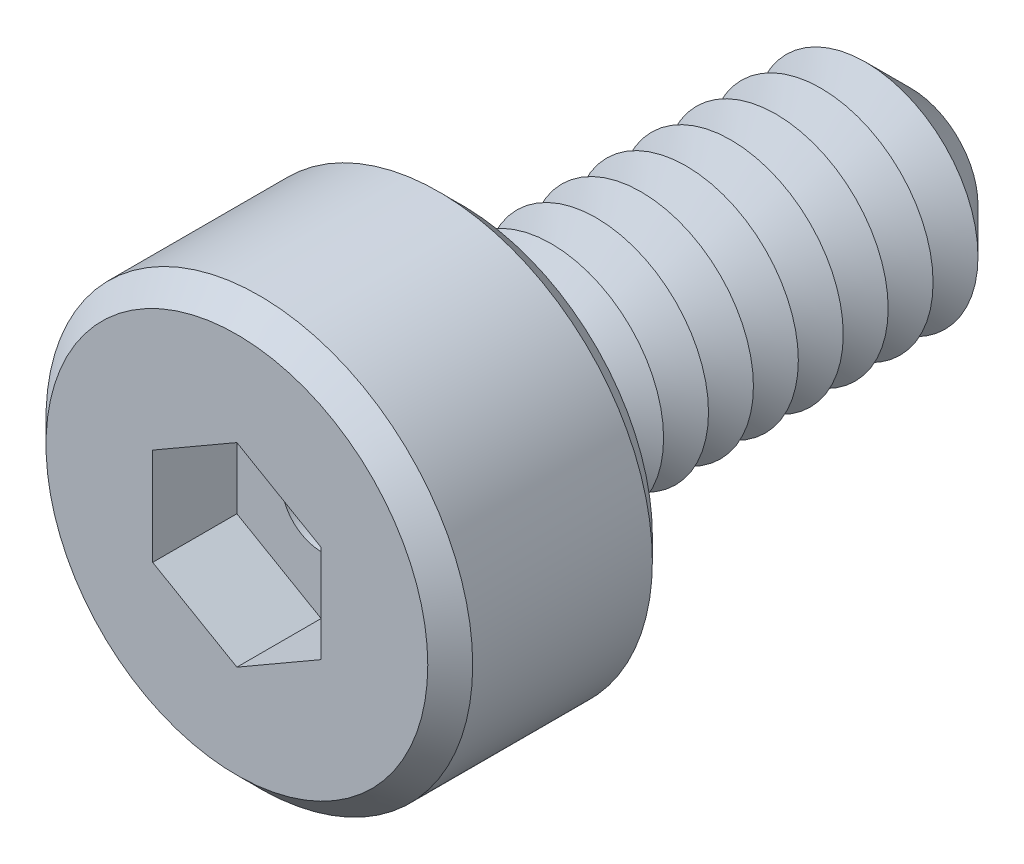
ISO-10303-21;
HEADER;
FILE_DESCRIPTION(('STEP AP214'),'2;1');
FILE_NAME('part.step','',(''),(''),'','','');
FILE_SCHEMA(('AUTOMOTIVE_DESIGN { 1 0 10303 214 1 1 1 1 }'));
ENDSEC;
DATA;
#1=APPLICATION_CONTEXT('core data for automotive mechanical design processes');
#2=APPLICATION_PROTOCOL_DEFINITION('international standard','automotive_design',2000,#1);
#3=PRODUCT_CONTEXT('',#1,'mechanical');
#4=PRODUCT('Part','Part','',(#3));
#5=PRODUCT_RELATED_PRODUCT_CATEGORY('part','',(#4));
#6=PRODUCT_DEFINITION_FORMATION('','',#4);
#7=PRODUCT_DEFINITION_CONTEXT('part definition',#1,'design');
#8=PRODUCT_DEFINITION('design','',#6,#7);
#9=PRODUCT_DEFINITION_SHAPE('','',#8);
#10=(LENGTH_UNIT() NAMED_UNIT(*) SI_UNIT(.MILLI.,.METRE.));
#11=(NAMED_UNIT(*) PLANE_ANGLE_UNIT() SI_UNIT($,.RADIAN.));
#12=(NAMED_UNIT(*) SI_UNIT($,.STERADIAN.) SOLID_ANGLE_UNIT());
#13=UNCERTAINTY_MEASURE_WITH_UNIT(LENGTH_MEASURE(1.E-05),#10,'distance_accuracy_value','');
#14=(GEOMETRIC_REPRESENTATION_CONTEXT(3) GLOBAL_UNCERTAINTY_ASSIGNED_CONTEXT((#13)) GLOBAL_UNIT_ASSIGNED_CONTEXT((#10,
#11,#12)) REPRESENTATION_CONTEXT('',''));
#15=CARTESIAN_POINT('',(0.,0.,0.));
#16=DIRECTION('',(0.,0.,1.));
#17=DIRECTION('',(1.,0.,0.));
#18=AXIS2_PLACEMENT_3D('',#15,#16,#17);
#19=CARTESIAN_POINT('',(0.,0.,2.));
#20=DIRECTION('',(0.,0.,-1.));
#21=DIRECTION('',(-1.,0.,0.));
#22=AXIS2_PLACEMENT_3D('',#19,#20,#21);
#23=CYLINDRICAL_SURFACE('',#22,1.9);
#24=CARTESIAN_POINT('',(0.,0.,0.2));
#25=DIRECTION('',(0.,0.,1.));
#26=DIRECTION('',(1.,0.,0.));
#27=AXIS2_PLACEMENT_3D('',#24,#25,#26);
#28=CIRCLE('',#27,1.9);
#29=CARTESIAN_POINT('',(1.9,0.,0.2));
#30=VERTEX_POINT('',#29);
#31=EDGE_CURVE('E248',#30,#30,#28,.T.);
#32=ORIENTED_EDGE('',*,*,#31,.T.);
#33=EDGE_LOOP('',(#32));
#34=FACE_BOUND('',#33,.T.);
#35=CARTESIAN_POINT('',(0.,0.,1.8));
#36=DIRECTION('',(0.,0.,1.));
#37=DIRECTION('',(1.,0.,0.));
#38=AXIS2_PLACEMENT_3D('',#35,#36,#37);
#39=CIRCLE('',#38,1.9);
#40=CARTESIAN_POINT('',(1.9,0.,1.8));
#41=VERTEX_POINT('',#40);
#42=EDGE_CURVE('E244',#41,#41,#39,.F.);
#43=ORIENTED_EDGE('',*,*,#42,.T.);
#44=EDGE_LOOP('',(#43));
#45=FACE_BOUND('',#44,.T.);
#46=ADVANCED_FACE('F39',(#34,#45),#23,.T.);
#47=CARTESIAN_POINT('',(0.,0.,2.));
#48=DIRECTION('',(0.,0.,1.));
#49=DIRECTION('',(1.,0.,0.));
#50=AXIS2_PLACEMENT_3D('',#47,#48,#49);
#51=PLANE('',#50);
#52=CARTESIAN_POINT('',(0.,0.,2.));
#53=DIRECTION('',(0.,0.,1.));
#54=DIRECTION('',(1.,0.,0.));
#55=AXIS2_PLACEMENT_3D('',#52,#53,#54);
#56=CIRCLE('',#55,1.7);
#57=CARTESIAN_POINT('',(1.7,0.,2.));
#58=VERTEX_POINT('',#57);
#59=EDGE_CURVE('E11',#58,#58,#56,.T.);
#60=ORIENTED_EDGE('',*,*,#59,.T.);
#61=EDGE_LOOP('',(#60));
#62=FACE_BOUND('',#61,.T.);
#63=DIRECTION('',(-0.866025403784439,0.5,0.));
#64=VECTOR('',#63,1.);
#65=CARTESIAN_POINT('',(0.75,0.43301270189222,2.));
#66=LINE('',#65,#64);
#67=CARTESIAN_POINT('',(0.75,0.43301270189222,2.));
#68=VERTEX_POINT('',#67);
#69=CARTESIAN_POINT('',(0.,0.866025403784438,2.));
#70=VERTEX_POINT('',#69);
#71=EDGE_CURVE('E55',#68,#70,#66,.T.);
#72=ORIENTED_EDGE('',*,*,#71,.F.);
#73=DIRECTION('',(0.,1.,0.));
#74=VECTOR('',#73,1.);
#75=CARTESIAN_POINT('',(0.75,-0.433012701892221,2.));
#76=LINE('',#75,#74);
#77=CARTESIAN_POINT('',(0.75,-0.433012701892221,2.));
#78=VERTEX_POINT('',#77);
#79=EDGE_CURVE('E150',#78,#68,#76,.T.);
#80=ORIENTED_EDGE('',*,*,#79,.F.);
#81=DIRECTION('',(0.866025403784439,0.499999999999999,0.));
#82=VECTOR('',#81,1.);
#83=CARTESIAN_POINT('',(0.,-0.866025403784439,2.));
#84=LINE('',#83,#82);
#85=CARTESIAN_POINT('',(0.,-0.866025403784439,2.));
#86=VERTEX_POINT('',#85);
#87=EDGE_CURVE('E147',#86,#78,#84,.T.);
#88=ORIENTED_EDGE('',*,*,#87,.F.);
#89=DIRECTION('',(0.866025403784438,-0.5,0.));
#90=VECTOR('',#89,1.);
#91=CARTESIAN_POINT('',(-0.750000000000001,-0.43301270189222,2.));
#92=LINE('',#91,#90);
#93=CARTESIAN_POINT('',(-0.750000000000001,-0.43301270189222,2.));
#94=VERTEX_POINT('',#93);
#95=EDGE_CURVE('E103',#94,#86,#92,.T.);
#96=ORIENTED_EDGE('',*,*,#95,.F.);
#97=DIRECTION('',(0.,-1.,0.));
#98=VECTOR('',#97,1.);
#99=CARTESIAN_POINT('',(-0.750000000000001,0.433012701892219,2.));
#100=LINE('',#99,#98);
#101=CARTESIAN_POINT('',(-0.750000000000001,0.433012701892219,2.));
#102=VERTEX_POINT('',#101);
#103=EDGE_CURVE('E141',#102,#94,#100,.T.);
#104=ORIENTED_EDGE('',*,*,#103,.F.);
#105=DIRECTION('',(-0.866025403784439,-0.499999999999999,0.));
#106=VECTOR('',#105,1.);
#107=CARTESIAN_POINT('',(0.,0.866025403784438,2.));
#108=LINE('',#107,#106);
#109=EDGE_CURVE('E137',#70,#102,#108,.T.);
#110=ORIENTED_EDGE('',*,*,#109,.F.);
#111=EDGE_LOOP('',(#72,#80,#88,#96,#104,#110));
#112=FACE_BOUND('',#111,.T.);
#113=ADVANCED_FACE('F266',(#62,#112),#51,.T.);
#114=CARTESIAN_POINT('',(0.,0.,0.));
#115=DIRECTION('',(0.,0.,1.));
#116=DIRECTION('',(1.,0.,0.));
#117=AXIS2_PLACEMENT_3D('',#114,#115,#116);
#118=PLANE('',#117);
#119=CARTESIAN_POINT('',(0.,0.,0.));
#120=DIRECTION('',(0.,0.,1.));
#121=DIRECTION('',(1.,0.,0.));
#122=AXIS2_PLACEMENT_3D('',#119,#120,#121);
#123=CIRCLE('',#122,1.7);
#124=CARTESIAN_POINT('',(1.7,0.,0.));
#125=VERTEX_POINT('',#124);
#126=EDGE_CURVE('E48',#125,#125,#123,.F.);
#127=ORIENTED_EDGE('',*,*,#126,.T.);
#128=EDGE_LOOP('',(#127));
#129=FACE_BOUND('',#128,.T.);
#130=CARTESIAN_POINT('',(0.,0.,0.));
#131=DIRECTION('',(0.,0.,1.));
#132=DIRECTION('',(1.,0.,0.));
#133=AXIS2_PLACEMENT_3D('',#130,#131,#132);
#134=CIRCLE('',#133,1.);
#135=CARTESIAN_POINT('',(1.,0.,0.));
#136=VERTEX_POINT('',#135);
#137=EDGE_CURVE('E236',#136,#136,#134,.T.);
#138=ORIENTED_EDGE('',*,*,#137,.T.);
#139=EDGE_LOOP('',(#138));
#140=FACE_BOUND('',#139,.T.);
#141=ADVANCED_FACE('F255',(#129,#140),#118,.F.);
#142=CARTESIAN_POINT('',(0.,0.,0.));
#143=DIRECTION('',(0.,0.,1.));
#144=DIRECTION('',(1.,0.,0.));
#145=AXIS2_PLACEMENT_3D('',#142,#143,#144);
#146=CONICAL_SURFACE('',#145,1.,1.0471975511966);
#147=CARTESIAN_POINT('',(0.,0.,-0.2));
#148=DIRECTION('',(0.,0.,1.));
#149=DIRECTION('',(1.,0.,0.));
#150=AXIS2_PLACEMENT_3D('',#147,#148,#149);
#151=CIRCLE('',#150,0.653589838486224);
#152=CARTESIAN_POINT('',(0.653589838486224,0.,-0.2));
#153=VERTEX_POINT('',#152);
#154=EDGE_CURVE('E232',#153,#153,#151,.T.);
#155=ORIENTED_EDGE('',*,*,#154,.T.);
#156=EDGE_LOOP('',(#155));
#157=FACE_BOUND('',#156,.T.);
#158=ORIENTED_EDGE('',*,*,#137,.F.);
#159=EDGE_LOOP('',(#158));
#160=FACE_BOUND('',#159,.T.);
#161=ADVANCED_FACE('F388',(#157,#160),#146,.T.);
#162=CARTESIAN_POINT('',(0.,0.,-0.2));
#163=DIRECTION('',(0.,0.,-1.));
#164=DIRECTION('',(-1.,0.,0.));
#165=AXIS2_PLACEMENT_3D('',#162,#163,#164);
#166=CONICAL_SURFACE('',#165,0.653589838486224,1.0471975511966);
#167=CARTESIAN_POINT('',(0.,0.,-0.4));
#168=DIRECTION('',(0.,0.,1.));
#169=DIRECTION('',(1.,0.,0.));
#170=AXIS2_PLACEMENT_3D('',#167,#168,#169);
#171=CIRCLE('',#170,1.);
#172=CARTESIAN_POINT('',(1.,0.,-0.4));
#173=VERTEX_POINT('',#172);
#174=EDGE_CURVE('E228',#173,#173,#171,.T.);
#175=ORIENTED_EDGE('',*,*,#174,.T.);
#176=EDGE_LOOP('',(#175));
#177=FACE_BOUND('',#176,.T.);
#178=ORIENTED_EDGE('',*,*,#154,.F.);
#179=EDGE_LOOP('',(#178));
#180=FACE_BOUND('',#179,.T.);
#181=ADVANCED_FACE('F384',(#177,#180),#166,.T.);
#182=CARTESIAN_POINT('',(0.,0.,-0.4));
#183=DIRECTION('',(0.,0.,1.));
#184=DIRECTION('',(1.,0.,0.));
#185=AXIS2_PLACEMENT_3D('',#182,#183,#184);
#186=CONICAL_SURFACE('',#185,1.,1.0471975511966);
#187=CARTESIAN_POINT('',(0.,0.,-0.6));
#188=DIRECTION('',(0.,0.,1.));
#189=DIRECTION('',(1.,0.,0.));
#190=AXIS2_PLACEMENT_3D('',#187,#188,#189);
#191=CIRCLE('',#190,0.653589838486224);
#192=CARTESIAN_POINT('',(0.653589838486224,0.,-0.6));
#193=VERTEX_POINT('',#192);
#194=EDGE_CURVE('E224',#193,#193,#191,.T.);
#195=ORIENTED_EDGE('',*,*,#194,.T.);
#196=EDGE_LOOP('',(#195));
#197=FACE_BOUND('',#196,.T.);
#198=ORIENTED_EDGE('',*,*,#174,.F.);
#199=EDGE_LOOP('',(#198));
#200=FACE_BOUND('',#199,.T.);
#201=ADVANCED_FACE('F380',(#197,#200),#186,.T.);
#202=CARTESIAN_POINT('',(0.,0.,-0.6));
#203=DIRECTION('',(0.,0.,-1.));
#204=DIRECTION('',(-1.,0.,0.));
#205=AXIS2_PLACEMENT_3D('',#202,#203,#204);
#206=CONICAL_SURFACE('',#205,0.653589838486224,1.0471975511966);
#207=CARTESIAN_POINT('',(0.,0.,-0.8));
#208=DIRECTION('',(0.,0.,1.));
#209=DIRECTION('',(1.,0.,0.));
#210=AXIS2_PLACEMENT_3D('',#207,#208,#209);
#211=CIRCLE('',#210,1.);
#212=CARTESIAN_POINT('',(1.,0.,-0.8));
#213=VERTEX_POINT('',#212);
#214=EDGE_CURVE('E220',#213,#213,#211,.T.);
#215=ORIENTED_EDGE('',*,*,#214,.T.);
#216=EDGE_LOOP('',(#215));
#217=FACE_BOUND('',#216,.T.);
#218=ORIENTED_EDGE('',*,*,#194,.F.);
#219=EDGE_LOOP('',(#218));
#220=FACE_BOUND('',#219,.T.);
#221=ADVANCED_FACE('F376',(#217,#220),#206,.T.);
#222=CARTESIAN_POINT('',(0.,0.,-0.8));
#223=DIRECTION('',(0.,0.,1.));
#224=DIRECTION('',(1.,0.,0.));
#225=AXIS2_PLACEMENT_3D('',#222,#223,#224);
#226=CONICAL_SURFACE('',#225,1.,1.0471975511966);
#227=CARTESIAN_POINT('',(0.,0.,-1.));
#228=DIRECTION('',(0.,0.,1.));
#229=DIRECTION('',(1.,0.,0.));
#230=AXIS2_PLACEMENT_3D('',#227,#228,#229);
#231=CIRCLE('',#230,0.653589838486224);
#232=CARTESIAN_POINT('',(0.653589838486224,0.,-1.));
#233=VERTEX_POINT('',#232);
#234=EDGE_CURVE('E216',#233,#233,#231,.T.);
#235=ORIENTED_EDGE('',*,*,#234,.T.);
#236=EDGE_LOOP('',(#235));
#237=FACE_BOUND('',#236,.T.);
#238=ORIENTED_EDGE('',*,*,#214,.F.);
#239=EDGE_LOOP('',(#238));
#240=FACE_BOUND('',#239,.T.);
#241=ADVANCED_FACE('F372',(#237,#240),#226,.T.);
#242=CARTESIAN_POINT('',(0.,0.,-1.));
#243=DIRECTION('',(0.,0.,-1.));
#244=DIRECTION('',(-1.,0.,0.));
#245=AXIS2_PLACEMENT_3D('',#242,#243,#244);
#246=CONICAL_SURFACE('',#245,0.653589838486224,1.0471975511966);
#247=CARTESIAN_POINT('',(0.,0.,-1.2));
#248=DIRECTION('',(0.,0.,1.));
#249=DIRECTION('',(1.,0.,0.));
#250=AXIS2_PLACEMENT_3D('',#247,#248,#249);
#251=CIRCLE('',#250,1.);
#252=CARTESIAN_POINT('',(1.,0.,-1.2));
#253=VERTEX_POINT('',#252);
#254=EDGE_CURVE('E212',#253,#253,#251,.T.);
#255=ORIENTED_EDGE('',*,*,#254,.T.);
#256=EDGE_LOOP('',(#255));
#257=FACE_BOUND('',#256,.T.);
#258=ORIENTED_EDGE('',*,*,#234,.F.);
#259=EDGE_LOOP('',(#258));
#260=FACE_BOUND('',#259,.T.);
#261=ADVANCED_FACE('F368',(#257,#260),#246,.T.);
#262=CARTESIAN_POINT('',(0.,0.,-1.2));
#263=DIRECTION('',(0.,0.,1.));
#264=DIRECTION('',(1.,0.,0.));
#265=AXIS2_PLACEMENT_3D('',#262,#263,#264);
#266=CONICAL_SURFACE('',#265,1.,1.0471975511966);
#267=CARTESIAN_POINT('',(0.,0.,-1.4));
#268=DIRECTION('',(0.,0.,1.));
#269=DIRECTION('',(1.,0.,0.));
#270=AXIS2_PLACEMENT_3D('',#267,#268,#269);
#271=CIRCLE('',#270,0.653589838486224);
#272=CARTESIAN_POINT('',(0.653589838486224,0.,-1.4));
#273=VERTEX_POINT('',#272);
#274=EDGE_CURVE('E208',#273,#273,#271,.T.);
#275=ORIENTED_EDGE('',*,*,#274,.T.);
#276=EDGE_LOOP('',(#275));
#277=FACE_BOUND('',#276,.T.);
#278=ORIENTED_EDGE('',*,*,#254,.F.);
#279=EDGE_LOOP('',(#278));
#280=FACE_BOUND('',#279,.T.);
#281=ADVANCED_FACE('F364',(#277,#280),#266,.T.);
#282=CARTESIAN_POINT('',(0.,0.,-1.4));
#283=DIRECTION('',(0.,0.,-1.));
#284=DIRECTION('',(-1.,0.,0.));
#285=AXIS2_PLACEMENT_3D('',#282,#283,#284);
#286=CONICAL_SURFACE('',#285,0.653589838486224,1.0471975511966);
#287=CARTESIAN_POINT('',(0.,0.,-1.6));
#288=DIRECTION('',(0.,0.,1.));
#289=DIRECTION('',(1.,0.,0.));
#290=AXIS2_PLACEMENT_3D('',#287,#288,#289);
#291=CIRCLE('',#290,1.);
#292=CARTESIAN_POINT('',(1.,0.,-1.6));
#293=VERTEX_POINT('',#292);
#294=EDGE_CURVE('E204',#293,#293,#291,.T.);
#295=ORIENTED_EDGE('',*,*,#294,.T.);
#296=EDGE_LOOP('',(#295));
#297=FACE_BOUND('',#296,.T.);
#298=ORIENTED_EDGE('',*,*,#274,.F.);
#299=EDGE_LOOP('',(#298));
#300=FACE_BOUND('',#299,.T.);
#301=ADVANCED_FACE('F360',(#297,#300),#286,.T.);
#302=CARTESIAN_POINT('',(0.,0.,-1.6));
#303=DIRECTION('',(0.,0.,1.));
#304=DIRECTION('',(1.,0.,0.));
#305=AXIS2_PLACEMENT_3D('',#302,#303,#304);
#306=CONICAL_SURFACE('',#305,1.,1.0471975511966);
#307=CARTESIAN_POINT('',(0.,0.,-1.8));
#308=DIRECTION('',(0.,0.,1.));
#309=DIRECTION('',(1.,0.,0.));
#310=AXIS2_PLACEMENT_3D('',#307,#308,#309);
#311=CIRCLE('',#310,0.653589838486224);
#312=CARTESIAN_POINT('',(0.653589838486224,0.,-1.8));
#313=VERTEX_POINT('',#312);
#314=EDGE_CURVE('E200',#313,#313,#311,.T.);
#315=ORIENTED_EDGE('',*,*,#314,.T.);
#316=EDGE_LOOP('',(#315));
#317=FACE_BOUND('',#316,.T.);
#318=ORIENTED_EDGE('',*,*,#294,.F.);
#319=EDGE_LOOP('',(#318));
#320=FACE_BOUND('',#319,.T.);
#321=ADVANCED_FACE('F356',(#317,#320),#306,.T.);
#322=CARTESIAN_POINT('',(0.,0.,-1.8));
#323=DIRECTION('',(0.,0.,-1.));
#324=DIRECTION('',(-1.,0.,0.));
#325=AXIS2_PLACEMENT_3D('',#322,#323,#324);
#326=CONICAL_SURFACE('',#325,0.653589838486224,1.0471975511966);
#327=CARTESIAN_POINT('',(0.,0.,-2.));
#328=DIRECTION('',(0.,0.,1.));
#329=DIRECTION('',(1.,0.,0.));
#330=AXIS2_PLACEMENT_3D('',#327,#328,#329);
#331=CIRCLE('',#330,1.);
#332=CARTESIAN_POINT('',(1.,0.,-2.));
#333=VERTEX_POINT('',#332);
#334=EDGE_CURVE('E196',#333,#333,#331,.T.);
#335=ORIENTED_EDGE('',*,*,#334,.T.);
#336=EDGE_LOOP('',(#335));
#337=FACE_BOUND('',#336,.T.);
#338=ORIENTED_EDGE('',*,*,#314,.F.);
#339=EDGE_LOOP('',(#338));
#340=FACE_BOUND('',#339,.T.);
#341=ADVANCED_FACE('F352',(#337,#340),#326,.T.);
#342=CARTESIAN_POINT('',(0.,0.,-2.));
#343=DIRECTION('',(0.,0.,1.));
#344=DIRECTION('',(1.,0.,0.));
#345=AXIS2_PLACEMENT_3D('',#342,#343,#344);
#346=CONICAL_SURFACE('',#345,1.,1.0471975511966);
#347=CARTESIAN_POINT('',(0.,0.,-2.2));
#348=DIRECTION('',(0.,0.,1.));
#349=DIRECTION('',(1.,0.,0.));
#350=AXIS2_PLACEMENT_3D('',#347,#348,#349);
#351=CIRCLE('',#350,0.653589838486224);
#352=CARTESIAN_POINT('',(0.653589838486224,0.,-2.2));
#353=VERTEX_POINT('',#352);
#354=EDGE_CURVE('E192',#353,#353,#351,.T.);
#355=ORIENTED_EDGE('',*,*,#354,.T.);
#356=EDGE_LOOP('',(#355));
#357=FACE_BOUND('',#356,.T.);
#358=ORIENTED_EDGE('',*,*,#334,.F.);
#359=EDGE_LOOP('',(#358));
#360=FACE_BOUND('',#359,.T.);
#361=ADVANCED_FACE('F348',(#357,#360),#346,.T.);
#362=CARTESIAN_POINT('',(0.,0.,-2.2));
#363=DIRECTION('',(0.,0.,-1.));
#364=DIRECTION('',(-1.,0.,0.));
#365=AXIS2_PLACEMENT_3D('',#362,#363,#364);
#366=CONICAL_SURFACE('',#365,0.653589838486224,1.0471975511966);
#367=CARTESIAN_POINT('',(0.,0.,-2.4));
#368=DIRECTION('',(0.,0.,1.));
#369=DIRECTION('',(1.,0.,0.));
#370=AXIS2_PLACEMENT_3D('',#367,#368,#369);
#371=CIRCLE('',#370,1.);
#372=CARTESIAN_POINT('',(1.,0.,-2.4));
#373=VERTEX_POINT('',#372);
#374=EDGE_CURVE('E188',#373,#373,#371,.T.);
#375=ORIENTED_EDGE('',*,*,#374,.T.);
#376=EDGE_LOOP('',(#375));
#377=FACE_BOUND('',#376,.T.);
#378=ORIENTED_EDGE('',*,*,#354,.F.);
#379=EDGE_LOOP('',(#378));
#380=FACE_BOUND('',#379,.T.);
#381=ADVANCED_FACE('F344',(#377,#380),#366,.T.);
#382=CARTESIAN_POINT('',(0.,0.,-2.4));
#383=DIRECTION('',(0.,0.,1.));
#384=DIRECTION('',(1.,0.,0.));
#385=AXIS2_PLACEMENT_3D('',#382,#383,#384);
#386=CONICAL_SURFACE('',#385,1.,1.0471975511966);
#387=CARTESIAN_POINT('',(0.,0.,-2.6));
#388=DIRECTION('',(0.,0.,1.));
#389=DIRECTION('',(1.,0.,0.));
#390=AXIS2_PLACEMENT_3D('',#387,#388,#389);
#391=CIRCLE('',#390,0.653589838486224);
#392=CARTESIAN_POINT('',(0.653589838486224,0.,-2.6));
#393=VERTEX_POINT('',#392);
#394=EDGE_CURVE('E184',#393,#393,#391,.T.);
#395=ORIENTED_EDGE('',*,*,#394,.T.);
#396=EDGE_LOOP('',(#395));
#397=FACE_BOUND('',#396,.T.);
#398=ORIENTED_EDGE('',*,*,#374,.F.);
#399=EDGE_LOOP('',(#398));
#400=FACE_BOUND('',#399,.T.);
#401=ADVANCED_FACE('F340',(#397,#400),#386,.T.);
#402=CARTESIAN_POINT('',(0.,0.,-2.6));
#403=DIRECTION('',(0.,0.,-1.));
#404=DIRECTION('',(-1.,0.,0.));
#405=AXIS2_PLACEMENT_3D('',#402,#403,#404);
#406=CONICAL_SURFACE('',#405,0.653589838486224,1.0471975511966);
#407=CARTESIAN_POINT('',(0.,0.,-2.8));
#408=DIRECTION('',(0.,0.,1.));
#409=DIRECTION('',(1.,0.,0.));
#410=AXIS2_PLACEMENT_3D('',#407,#408,#409);
#411=CIRCLE('',#410,1.);
#412=CARTESIAN_POINT('',(1.,0.,-2.8));
#413=VERTEX_POINT('',#412);
#414=EDGE_CURVE('E180',#413,#413,#411,.T.);
#415=ORIENTED_EDGE('',*,*,#414,.T.);
#416=EDGE_LOOP('',(#415));
#417=FACE_BOUND('',#416,.T.);
#418=ORIENTED_EDGE('',*,*,#394,.F.);
#419=EDGE_LOOP('',(#418));
#420=FACE_BOUND('',#419,.T.);
#421=ADVANCED_FACE('F336',(#417,#420),#406,.T.);
#422=CARTESIAN_POINT('',(0.,0.,-2.8));
#423=DIRECTION('',(0.,0.,1.));
#424=DIRECTION('',(1.,0.,0.));
#425=AXIS2_PLACEMENT_3D('',#422,#423,#424);
#426=CONICAL_SURFACE('',#425,1.,1.0471975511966);
#427=CARTESIAN_POINT('',(0.,0.,-3.));
#428=DIRECTION('',(0.,0.,1.));
#429=DIRECTION('',(1.,0.,0.));
#430=AXIS2_PLACEMENT_3D('',#427,#428,#429);
#431=CIRCLE('',#430,0.653589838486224);
#432=CARTESIAN_POINT('',(0.653589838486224,0.,-3.));
#433=VERTEX_POINT('',#432);
#434=EDGE_CURVE('E176',#433,#433,#431,.T.);
#435=ORIENTED_EDGE('',*,*,#434,.T.);
#436=EDGE_LOOP('',(#435));
#437=FACE_BOUND('',#436,.T.);
#438=ORIENTED_EDGE('',*,*,#414,.F.);
#439=EDGE_LOOP('',(#438));
#440=FACE_BOUND('',#439,.T.);
#441=ADVANCED_FACE('F332',(#437,#440),#426,.T.);
#442=CARTESIAN_POINT('',(0.,0.,-3.));
#443=DIRECTION('',(0.,0.,-1.));
#444=DIRECTION('',(-1.,0.,0.));
#445=AXIS2_PLACEMENT_3D('',#442,#443,#444);
#446=CONICAL_SURFACE('',#445,0.653589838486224,1.0471975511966);
#447=CARTESIAN_POINT('',(0.,0.,-3.2));
#448=DIRECTION('',(0.,0.,1.));
#449=DIRECTION('',(1.,0.,0.));
#450=AXIS2_PLACEMENT_3D('',#447,#448,#449);
#451=CIRCLE('',#450,1.);
#452=CARTESIAN_POINT('',(1.,0.,-3.2));
#453=VERTEX_POINT('',#452);
#454=EDGE_CURVE('E173',#453,#453,#451,.T.);
#455=ORIENTED_EDGE('',*,*,#454,.T.);
#456=EDGE_LOOP('',(#455));
#457=FACE_BOUND('',#456,.T.);
#458=ORIENTED_EDGE('',*,*,#434,.F.);
#459=EDGE_LOOP('',(#458));
#460=FACE_BOUND('',#459,.T.);
#461=ADVANCED_FACE('F328',(#457,#460),#446,.T.);
#462=CARTESIAN_POINT('',(0.,0.,-3.2));
#463=DIRECTION('',(0.,0.,1.));
#464=DIRECTION('',(1.,0.,0.));
#465=AXIS2_PLACEMENT_3D('',#462,#463,#464);
#466=CONICAL_SURFACE('',#465,1.,1.0471975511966);
#467=CARTESIAN_POINT('',(0.,0.,-3.4));
#468=DIRECTION('',(0.,0.,1.));
#469=DIRECTION('',(1.,0.,0.));
#470=AXIS2_PLACEMENT_3D('',#467,#468,#469);
#471=CIRCLE('',#470,0.653589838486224);
#472=CARTESIAN_POINT('',(0.653589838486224,0.,-3.4));
#473=VERTEX_POINT('',#472);
#474=EDGE_CURVE('E169',#473,#473,#471,.T.);
#475=ORIENTED_EDGE('',*,*,#474,.T.);
#476=EDGE_LOOP('',(#475));
#477=FACE_BOUND('',#476,.T.);
#478=ORIENTED_EDGE('',*,*,#454,.F.);
#479=EDGE_LOOP('',(#478));
#480=FACE_BOUND('',#479,.T.);
#481=ADVANCED_FACE('F324',(#477,#480),#466,.T.);
#482=CARTESIAN_POINT('',(0.,0.,-3.4));
#483=DIRECTION('',(0.,0.,-1.));
#484=DIRECTION('',(-1.,0.,0.));
#485=AXIS2_PLACEMENT_3D('',#482,#483,#484);
#486=CONICAL_SURFACE('',#485,0.653589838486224,1.0471975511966);
#487=CARTESIAN_POINT('',(0.,0.,-3.6));
#488=DIRECTION('',(0.,0.,1.));
#489=DIRECTION('',(1.,0.,0.));
#490=AXIS2_PLACEMENT_3D('',#487,#488,#489);
#491=CIRCLE('',#490,1.);
#492=CARTESIAN_POINT('',(1.,0.,-3.6));
#493=VERTEX_POINT('',#492);
#494=EDGE_CURVE('E156',#493,#493,#491,.T.);
#495=ORIENTED_EDGE('',*,*,#494,.T.);
#496=EDGE_LOOP('',(#495));
#497=FACE_BOUND('',#496,.T.);
#498=ORIENTED_EDGE('',*,*,#474,.F.);
#499=EDGE_LOOP('',(#498));
#500=FACE_BOUND('',#499,.T.);
#501=ADVANCED_FACE('F320',(#497,#500),#486,.T.);
#502=CARTESIAN_POINT('',(0.,0.,-4.));
#503=DIRECTION('',(0.,0.,-1.));
#504=DIRECTION('',(-1.,0.,0.));
#505=AXIS2_PLACEMENT_3D('',#502,#503,#504);
#506=PLANE('',#505);
#507=CARTESIAN_POINT('',(0.,0.,-4.));
#508=DIRECTION('',(0.,0.,-1.));
#509=DIRECTION('',(-1.,0.,0.));
#510=AXIS2_PLACEMENT_3D('',#507,#508,#509);
#511=CIRCLE('',#510,0.35);
#512=CARTESIAN_POINT('',(-0.35,0.,-4.));
#513=VERTEX_POINT('',#512);
#514=EDGE_CURVE('E138',#513,#513,#511,.F.);
#515=ORIENTED_EDGE('',*,*,#514,.T.);
#516=EDGE_LOOP('',(#515));
#517=FACE_BOUND('',#516,.T.);
#518=CARTESIAN_POINT('',(0.,0.,-4.));
#519=DIRECTION('',(0.,0.,-1.));
#520=DIRECTION('',(-1.,0.,0.));
#521=AXIS2_PLACEMENT_3D('',#518,#519,#520);
#522=CIRCLE('',#521,0.599999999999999);
#523=CARTESIAN_POINT('',(-0.599999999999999,0.,-4.));
#524=VERTEX_POINT('',#523);
#525=EDGE_CURVE('E240',#524,#524,#522,.T.);
#526=ORIENTED_EDGE('',*,*,#525,.T.);
#527=EDGE_LOOP('',(#526));
#528=FACE_BOUND('',#527,.T.);
#529=ADVANCED_FACE('F323',(#517,#528),#506,.T.);
#530=CARTESIAN_POINT('',(0.,0.,-4.));
#531=DIRECTION('',(0.,0.,1.));
#532=DIRECTION('',(1.,0.,0.));
#533=AXIS2_PLACEMENT_3D('',#530,#531,#532);
#534=CONICAL_SURFACE('',#533,0.599999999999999,0.785398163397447);
#535=ORIENTED_EDGE('',*,*,#494,.F.);
#536=EDGE_LOOP('',(#535));
#537=FACE_BOUND('',#536,.T.);
#538=ORIENTED_EDGE('',*,*,#525,.F.);
#539=EDGE_LOOP('',(#538));
#540=FACE_BOUND('',#539,.T.);
#541=ADVANCED_FACE('F319',(#537,#540),#534,.T.);
#542=CARTESIAN_POINT('',(0.75,0.43301270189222,1.25));
#543=DIRECTION('',(0.5,0.866025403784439,0.));
#544=DIRECTION('',(-0.866025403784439,0.5,0.));
#545=AXIS2_PLACEMENT_3D('',#542,#543,#544);
#546=PLANE('',#545);
#547=ORIENTED_EDGE('',*,*,#71,.T.);
#548=DIRECTION('',(0.,0.,1.));
#549=VECTOR('',#548,1.);
#550=CARTESIAN_POINT('',(0.,0.866025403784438,1.25));
#551=LINE('',#550,#549);
#552=CARTESIAN_POINT('',(0.,0.866025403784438,1.25));
#553=VERTEX_POINT('',#552);
#554=EDGE_CURVE('E85',#553,#70,#551,.T.);
#555=ORIENTED_EDGE('',*,*,#554,.F.);
#556=DIRECTION('',(-0.866025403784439,0.5,0.));
#557=VECTOR('',#556,1.);
#558=CARTESIAN_POINT('',(0.75,0.43301270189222,1.25));
#559=LINE('',#558,#557);
#560=CARTESIAN_POINT('',(0.75,0.43301270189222,1.25));
#561=VERTEX_POINT('',#560);
#562=EDGE_CURVE('E153',#561,#553,#559,.T.);
#563=ORIENTED_EDGE('',*,*,#562,.F.);
#564=DIRECTION('',(0.,0.,1.));
#565=VECTOR('',#564,1.);
#566=CARTESIAN_POINT('',(0.75,0.43301270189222,1.25));
#567=LINE('',#566,#565);
#568=EDGE_CURVE('E63',#561,#68,#567,.T.);
#569=ORIENTED_EDGE('',*,*,#568,.T.);
#570=EDGE_LOOP('',(#547,#555,#563,#569));
#571=FACE_BOUND('',#570,.T.);
#572=ADVANCED_FACE('F309',(#571),#546,.F.);
#573=CARTESIAN_POINT('',(0.75,-0.433012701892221,1.25));
#574=DIRECTION('',(1.,0.,0.));
#575=DIRECTION('',(0.,0.,-1.));
#576=AXIS2_PLACEMENT_3D('',#573,#574,#575);
#577=PLANE('',#576);
#578=ORIENTED_EDGE('',*,*,#79,.T.);
#579=ORIENTED_EDGE('',*,*,#568,.F.);
#580=DIRECTION('',(0.,1.,0.));
#581=VECTOR('',#580,1.);
#582=CARTESIAN_POINT('',(0.75,-0.433012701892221,1.25));
#583=LINE('',#582,#581);
#584=CARTESIAN_POINT('',(0.75,-0.433012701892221,1.25));
#585=VERTEX_POINT('',#584);
#586=EDGE_CURVE('E117',#585,#561,#583,.T.);
#587=ORIENTED_EDGE('',*,*,#586,.F.);
#588=DIRECTION('',(0.,0.,1.));
#589=VECTOR('',#588,1.);
#590=CARTESIAN_POINT('',(0.75,-0.433012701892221,1.25));
#591=LINE('',#590,#589);
#592=EDGE_CURVE('E108',#585,#78,#591,.T.);
#593=ORIENTED_EDGE('',*,*,#592,.T.);
#594=EDGE_LOOP('',(#578,#579,#587,#593));
#595=FACE_BOUND('',#594,.T.);
#596=ADVANCED_FACE('F306',(#595),#577,.F.);
#597=CARTESIAN_POINT('',(0.,-0.866025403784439,1.25));
#598=DIRECTION('',(0.499999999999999,-0.866025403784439,0.));
#599=DIRECTION('',(0.866025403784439,0.499999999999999,0.));
#600=AXIS2_PLACEMENT_3D('',#597,#598,#599);
#601=PLANE('',#600);
#602=ORIENTED_EDGE('',*,*,#87,.T.);
#603=ORIENTED_EDGE('',*,*,#592,.F.);
#604=DIRECTION('',(0.866025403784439,0.499999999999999,0.));
#605=VECTOR('',#604,1.);
#606=CARTESIAN_POINT('',(0.,-0.866025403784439,1.25));
#607=LINE('',#606,#605);
#608=CARTESIAN_POINT('',(0.,-0.866025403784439,1.25));
#609=VERTEX_POINT('',#608);
#610=EDGE_CURVE('E112',#609,#585,#607,.T.);
#611=ORIENTED_EDGE('',*,*,#610,.F.);
#612=DIRECTION('',(0.,0.,1.));
#613=VECTOR('',#612,1.);
#614=CARTESIAN_POINT('',(0.,-0.866025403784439,1.25));
#615=LINE('',#614,#613);
#616=EDGE_CURVE('E96',#609,#86,#615,.T.);
#617=ORIENTED_EDGE('',*,*,#616,.T.);
#618=EDGE_LOOP('',(#602,#603,#611,#617));
#619=FACE_BOUND('',#618,.T.);
#620=ADVANCED_FACE('F113',(#619),#601,.F.);
#621=CARTESIAN_POINT('',(-0.750000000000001,-0.43301270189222,1.25));
#622=DIRECTION('',(-0.5,-0.866025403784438,0.));
#623=DIRECTION('',(0.866025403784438,-0.5,0.));
#624=AXIS2_PLACEMENT_3D('',#621,#622,#623);
#625=PLANE('',#624);
#626=ORIENTED_EDGE('',*,*,#95,.T.);
#627=ORIENTED_EDGE('',*,*,#616,.F.);
#628=DIRECTION('',(0.866025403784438,-0.5,0.));
#629=VECTOR('',#628,1.);
#630=CARTESIAN_POINT('',(-0.750000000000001,-0.43301270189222,1.25));
#631=LINE('',#630,#629);
#632=CARTESIAN_POINT('',(-0.750000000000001,-0.43301270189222,1.25));
#633=VERTEX_POINT('',#632);
#634=EDGE_CURVE('E100',#633,#609,#631,.T.);
#635=ORIENTED_EDGE('',*,*,#634,.F.);
#636=DIRECTION('',(0.,0.,1.));
#637=VECTOR('',#636,1.);
#638=CARTESIAN_POINT('',(-0.750000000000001,-0.43301270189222,1.25));
#639=LINE('',#638,#637);
#640=EDGE_CURVE('E109',#633,#94,#639,.T.);
#641=ORIENTED_EDGE('',*,*,#640,.T.);
#642=EDGE_LOOP('',(#626,#627,#635,#641));
#643=FACE_BOUND('',#642,.T.);
#644=ADVANCED_FACE('F98',(#643),#625,.F.);
#645=CARTESIAN_POINT('',(-0.750000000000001,0.433012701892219,1.25));
#646=DIRECTION('',(-1.,0.,0.));
#647=DIRECTION('',(0.,0.,1.));
#648=AXIS2_PLACEMENT_3D('',#645,#646,#647);
#649=PLANE('',#648);
#650=ORIENTED_EDGE('',*,*,#103,.T.);
#651=ORIENTED_EDGE('',*,*,#640,.F.);
#652=DIRECTION('',(0.,-1.,0.));
#653=VECTOR('',#652,1.);
#654=CARTESIAN_POINT('',(-0.750000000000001,0.433012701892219,1.25));
#655=LINE('',#654,#653);
#656=CARTESIAN_POINT('',(-0.750000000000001,0.433012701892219,1.25));
#657=VERTEX_POINT('',#656);
#658=EDGE_CURVE('E123',#657,#633,#655,.T.);
#659=ORIENTED_EDGE('',*,*,#658,.F.);
#660=DIRECTION('',(0.,0.,1.));
#661=VECTOR('',#660,1.);
#662=CARTESIAN_POINT('',(-0.750000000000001,0.433012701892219,1.25));
#663=LINE('',#662,#661);
#664=EDGE_CURVE('E161',#657,#102,#663,.T.);
#665=ORIENTED_EDGE('',*,*,#664,.T.);
#666=EDGE_LOOP('',(#650,#651,#659,#665));
#667=FACE_BOUND('',#666,.T.);
#668=ADVANCED_FACE('F303',(#667),#649,.F.);
#669=CARTESIAN_POINT('',(0.,0.866025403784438,1.25));
#670=DIRECTION('',(-0.5,0.866025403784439,0.));
#671=DIRECTION('',(-0.866025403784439,-0.5,0.));
#672=AXIS2_PLACEMENT_3D('',#669,#670,#671);
#673=PLANE('',#672);
#674=ORIENTED_EDGE('',*,*,#109,.T.);
#675=ORIENTED_EDGE('',*,*,#664,.F.);
#676=DIRECTION('',(-0.866025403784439,-0.499999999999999,0.));
#677=VECTOR('',#676,1.);
#678=CARTESIAN_POINT('',(0.,0.866025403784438,1.25));
#679=LINE('',#678,#677);
#680=EDGE_CURVE('E129',#553,#657,#679,.T.);
#681=ORIENTED_EDGE('',*,*,#680,.F.);
#682=ORIENTED_EDGE('',*,*,#554,.T.);
#683=EDGE_LOOP('',(#674,#675,#681,#682));
#684=FACE_BOUND('',#683,.T.);
#685=ADVANCED_FACE('F281',(#684),#673,.F.);
#686=CARTESIAN_POINT('',(0.,0.,1.25));
#687=DIRECTION('',(0.,0.,1.));
#688=DIRECTION('',(1.,0.,0.));
#689=AXIS2_PLACEMENT_3D('',#686,#687,#688);
#690=PLANE('',#689);
#691=CARTESIAN_POINT('',(0.,0.,1.25));
#692=DIRECTION('',(0.,0.,1.));
#693=DIRECTION('',(1.,0.,0.));
#694=AXIS2_PLACEMENT_3D('',#691,#692,#693);
#695=CIRCLE('',#694,0.35);
#696=CARTESIAN_POINT('',(0.35,0.,1.25));
#697=VERTEX_POINT('',#696);
#698=EDGE_CURVE('E289',#697,#697,#695,.T.);
#699=ORIENTED_EDGE('',*,*,#698,.F.);
#700=EDGE_LOOP('',(#699));
#701=FACE_BOUND('',#700,.T.);
#702=ORIENTED_EDGE('',*,*,#562,.T.);
#703=ORIENTED_EDGE('',*,*,#680,.T.);
#704=ORIENTED_EDGE('',*,*,#658,.T.);
#705=ORIENTED_EDGE('',*,*,#634,.T.);
#706=ORIENTED_EDGE('',*,*,#610,.T.);
#707=ORIENTED_EDGE('',*,*,#586,.T.);
#708=EDGE_LOOP('',(#702,#703,#704,#705,#706,#707));
#709=FACE_BOUND('',#708,.T.);
#710=ADVANCED_FACE('F120',(#701,#709),#690,.T.);
#711=CARTESIAN_POINT('',(0.,0.,-4.98994949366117));
#712=DIRECTION('',(0.,0.,1.));
#713=DIRECTION('',(1.,0.,0.));
#714=AXIS2_PLACEMENT_3D('',#711,#712,#713);
#715=CYLINDRICAL_SURFACE('',#714,0.35);
#716=ORIENTED_EDGE('',*,*,#698,.T.);
#717=EDGE_LOOP('',(#716));
#718=FACE_BOUND('',#717,.T.);
#719=ORIENTED_EDGE('',*,*,#514,.F.);
#720=EDGE_LOOP('',(#719));
#721=FACE_BOUND('',#720,.T.);
#722=ADVANCED_FACE('F261',(#718,#721),#715,.F.);
#723=CARTESIAN_POINT('',(0.,0.,0.2));
#724=DIRECTION('',(0.,0.,1.));
#725=DIRECTION('',(1.,0.,0.));
#726=AXIS2_PLACEMENT_3D('',#723,#724,#725);
#727=CONICAL_SURFACE('',#726,1.9,0.785398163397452);
#728=ORIENTED_EDGE('',*,*,#126,.F.);
#729=EDGE_LOOP('',(#728));
#730=FACE_BOUND('',#729,.T.);
#731=ORIENTED_EDGE('',*,*,#31,.F.);
#732=EDGE_LOOP('',(#731));
#733=FACE_BOUND('',#732,.T.);
#734=ADVANCED_FACE('F258',(#730,#733),#727,.T.);
#735=CARTESIAN_POINT('',(0.,0.,2.));
#736=DIRECTION('',(0.,0.,-1.));
#737=DIRECTION('',(-1.,0.,0.));
#738=AXIS2_PLACEMENT_3D('',#735,#736,#737);
#739=CONICAL_SURFACE('',#738,1.7,0.785398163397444);
#740=ORIENTED_EDGE('',*,*,#42,.F.);
#741=EDGE_LOOP('',(#740));
#742=FACE_BOUND('',#741,.T.);
#743=ORIENTED_EDGE('',*,*,#59,.F.);
#744=EDGE_LOOP('',(#743));
#745=FACE_BOUND('',#744,.T.);
#746=ADVANCED_FACE('F41',(#742,#745),#739,.T.);
#747=CLOSED_SHELL('',(#46,#113,#141,#161,#181,#201,#221,#241,#261,#281,#301,#321,#341,#361,#381,
#401,#421,#441,#461,#481,#501,#529,#541,#572,#596,#620,#644,#668,#685,#710,#722,#734,#746));
#748=MANIFOLD_SOLID_BREP('B2',#747);
#749=ADVANCED_BREP_SHAPE_REPRESENTATION('',(#18,#748),#14);
#750=SHAPE_DEFINITION_REPRESENTATION(#9,#749);
ENDSEC;
END-ISO-10303-21;
